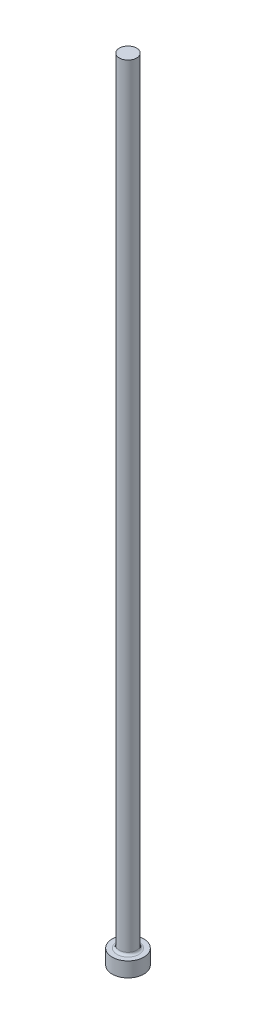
ISO-10303-21;
HEADER;
FILE_DESCRIPTION(('STEP AP214'),'2;1');
FILE_NAME('part.step','',(''),(''),'','','');
FILE_SCHEMA(('AUTOMOTIVE_DESIGN { 1 0 10303 214 1 1 1 1 }'));
ENDSEC;
DATA;
#1=APPLICATION_CONTEXT('core data for automotive mechanical design processes');
#2=APPLICATION_PROTOCOL_DEFINITION('international standard','automotive_design',2000,#1);
#3=PRODUCT_CONTEXT('',#1,'mechanical');
#4=PRODUCT('Part','Part','',(#3));
#5=PRODUCT_RELATED_PRODUCT_CATEGORY('part','',(#4));
#6=PRODUCT_DEFINITION_FORMATION('','',#4);
#7=PRODUCT_DEFINITION_CONTEXT('part definition',#1,'design');
#8=PRODUCT_DEFINITION('design','',#6,#7);
#9=PRODUCT_DEFINITION_SHAPE('','',#8);
#10=(LENGTH_UNIT() NAMED_UNIT(*) SI_UNIT(.MILLI.,.METRE.));
#11=(NAMED_UNIT(*) PLANE_ANGLE_UNIT() SI_UNIT($,.RADIAN.));
#12=(NAMED_UNIT(*) SI_UNIT($,.STERADIAN.) SOLID_ANGLE_UNIT());
#13=UNCERTAINTY_MEASURE_WITH_UNIT(LENGTH_MEASURE(1.E-05),#10,'distance_accuracy_value','');
#14=(GEOMETRIC_REPRESENTATION_CONTEXT(3) GLOBAL_UNCERTAINTY_ASSIGNED_CONTEXT((#13)) GLOBAL_UNIT_ASSIGNED_CONTEXT((#10,
#11,#12)) REPRESENTATION_CONTEXT('',''));
#15=CARTESIAN_POINT('',(0.,0.,0.));
#16=DIRECTION('',(0.,0.,1.));
#17=DIRECTION('',(1.,0.,0.));
#18=AXIS2_PLACEMENT_3D('',#15,#16,#17);
#19=CARTESIAN_POINT('',(2.77749,254.,0.));
#20=DIRECTION('',(0.,-1.,0.));
#21=DIRECTION('',(1.,0.,0.));
#22=AXIS2_PLACEMENT_3D('',#19,#20,#21);
#23=PLANE('',#22);
#24=CARTESIAN_POINT('',(0.,254.,0.));
#25=DIRECTION('',(0.,1.,0.));
#26=DIRECTION('',(-1.,0.,0.));
#27=AXIS2_PLACEMENT_3D('',#24,#25,#26);
#28=CIRCLE('',#27,2.77749000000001);
#29=CARTESIAN_POINT('',(-2.77749000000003,254.,0.));
#30=VERTEX_POINT('',#29);
#31=EDGE_CURVE('E10',#30,#30,#28,.T.);
#32=ORIENTED_EDGE('',*,*,#31,.T.);
#33=EDGE_LOOP('',(#32));
#34=FACE_BOUND('',#33,.T.);
#35=ADVANCED_FACE('F30',(#34),#23,.F.);
#36=CARTESIAN_POINT('',(0.,254.,0.));
#37=DIRECTION('',(0.,1.,0.));
#38=DIRECTION('',(-1.,0.,0.));
#39=AXIS2_PLACEMENT_3D('',#36,#37,#38);
#40=CYLINDRICAL_SURFACE('',#39,2.77749000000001);
#41=ORIENTED_EDGE('',*,*,#31,.F.);
#42=EDGE_LOOP('',(#41));
#43=FACE_BOUND('',#42,.T.);
#44=CARTESIAN_POINT('',(0.,5.51180000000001,0.));
#45=DIRECTION('',(0.,1.,0.));
#46=DIRECTION('',(-1.,0.,0.));
#47=AXIS2_PLACEMENT_3D('',#44,#45,#46);
#48=CIRCLE('',#47,2.77749);
#49=CARTESIAN_POINT('',(-2.77749,5.51180000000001,0.));
#50=VERTEX_POINT('',#49);
#51=EDGE_CURVE('E36',#50,#50,#48,.T.);
#52=ORIENTED_EDGE('',*,*,#51,.T.);
#53=EDGE_LOOP('',(#52));
#54=FACE_BOUND('',#53,.T.);
#55=ADVANCED_FACE('F65',(#43,#54),#40,.T.);
#56=CARTESIAN_POINT('',(0.,5.5118,0.));
#57=DIRECTION('',(0.,1.,0.));
#58=DIRECTION('',(-1.,0.,0.));
#59=AXIS2_PLACEMENT_3D('',#56,#57,#58);
#60=TOROIDAL_SURFACE('',#59,3.53949,0.762);
#61=ORIENTED_EDGE('',*,*,#51,.F.);
#62=EDGE_LOOP('',(#61));
#63=FACE_BOUND('',#62,.T.);
#64=CARTESIAN_POINT('',(0.,4.7498,0.));
#65=DIRECTION('',(0.,1.,0.));
#66=DIRECTION('',(-1.,0.,0.));
#67=AXIS2_PLACEMENT_3D('',#64,#65,#66);
#68=CIRCLE('',#67,3.53949);
#69=CARTESIAN_POINT('',(-3.53949,4.7498,0.));
#70=VERTEX_POINT('',#69);
#71=EDGE_CURVE('E40',#70,#70,#68,.T.);
#72=ORIENTED_EDGE('',*,*,#71,.T.);
#73=EDGE_LOOP('',(#72));
#74=FACE_BOUND('',#73,.T.);
#75=ADVANCED_FACE('F69',(#63,#74),#60,.F.);
#76=CARTESIAN_POINT('',(5.08,4.7498,0.));
#77=DIRECTION('',(0.,-1.,0.));
#78=DIRECTION('',(1.,0.,0.));
#79=AXIS2_PLACEMENT_3D('',#76,#77,#78);
#80=PLANE('',#79);
#81=ORIENTED_EDGE('',*,*,#71,.F.);
#82=EDGE_LOOP('',(#81));
#83=FACE_BOUND('',#82,.T.);
#84=CARTESIAN_POINT('',(0.,4.7498,0.));
#85=DIRECTION('',(0.,1.,0.));
#86=DIRECTION('',(-1.,0.,0.));
#87=AXIS2_PLACEMENT_3D('',#84,#85,#86);
#88=CIRCLE('',#87,5.08);
#89=CARTESIAN_POINT('',(-5.08,4.7498,0.));
#90=VERTEX_POINT('',#89);
#91=EDGE_CURVE('E44',#90,#90,#88,.T.);
#92=ORIENTED_EDGE('',*,*,#91,.T.);
#93=EDGE_LOOP('',(#92));
#94=FACE_BOUND('',#93,.T.);
#95=ADVANCED_FACE('F61',(#83,#94),#80,.F.);
#96=CARTESIAN_POINT('',(0.,254.,0.));
#97=DIRECTION('',(0.,1.,0.));
#98=DIRECTION('',(-1.,0.,0.));
#99=AXIS2_PLACEMENT_3D('',#96,#97,#98);
#100=CYLINDRICAL_SURFACE('',#99,5.08);
#101=ORIENTED_EDGE('',*,*,#91,.F.);
#102=EDGE_LOOP('',(#101));
#103=FACE_BOUND('',#102,.T.);
#104=CARTESIAN_POINT('',(0.,0.,0.));
#105=DIRECTION('',(0.,1.,0.));
#106=DIRECTION('',(-1.,0.,0.));
#107=AXIS2_PLACEMENT_3D('',#104,#105,#106);
#108=CIRCLE('',#107,5.08);
#109=CARTESIAN_POINT('',(-5.08,0.,0.));
#110=VERTEX_POINT('',#109);
#111=EDGE_CURVE('E49',#110,#110,#108,.T.);
#112=ORIENTED_EDGE('',*,*,#111,.T.);
#113=EDGE_LOOP('',(#112));
#114=FACE_BOUND('',#113,.T.);
#115=ADVANCED_FACE('F53',(#103,#114),#100,.T.);
#116=CARTESIAN_POINT('',(0.,0.,0.));
#117=DIRECTION('',(0.,1.,0.));
#118=DIRECTION('',(-1.,0.,0.));
#119=AXIS2_PLACEMENT_3D('',#116,#117,#118);
#120=PLANE('',#119);
#121=ORIENTED_EDGE('',*,*,#111,.F.);
#122=EDGE_LOOP('',(#121));
#123=FACE_BOUND('',#122,.T.);
#124=ADVANCED_FACE('F55',(#123),#120,.F.);
#125=CLOSED_SHELL('',(#35,#55,#75,#95,#115,#124));
#126=MANIFOLD_SOLID_BREP('B2',#125);
#127=ADVANCED_BREP_SHAPE_REPRESENTATION('',(#18,#126),#14);
#128=SHAPE_DEFINITION_REPRESENTATION(#9,#127);
ENDSEC;
END-ISO-10303-21;
